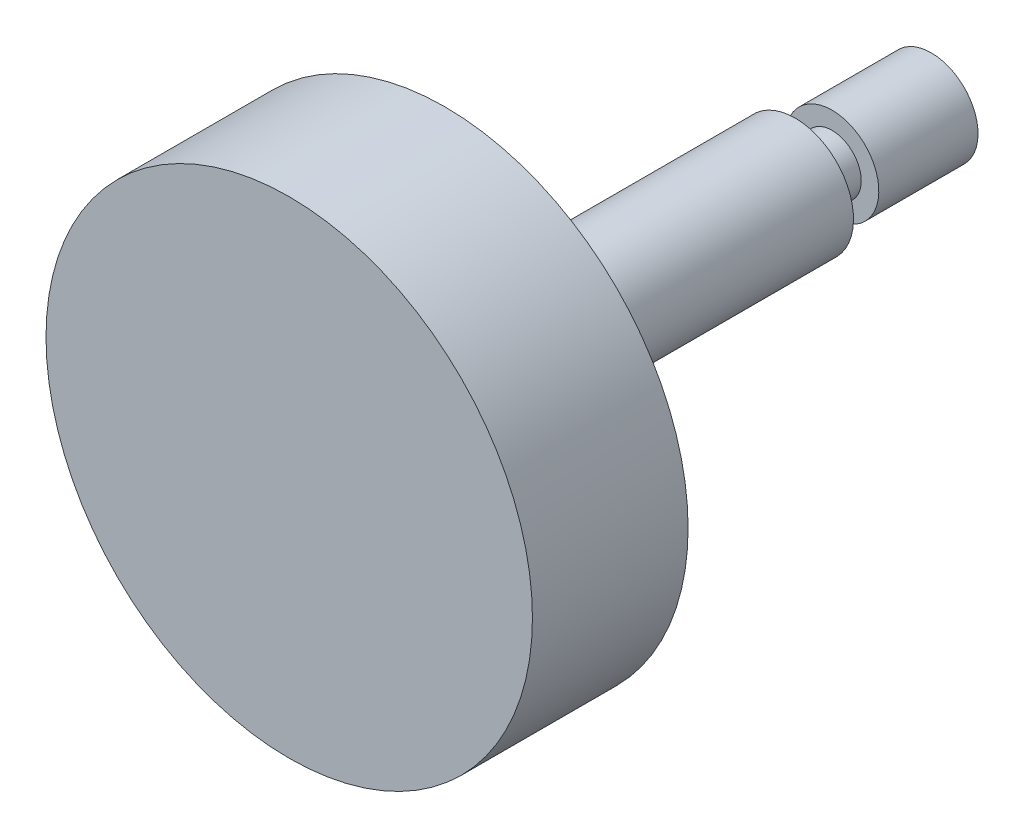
ISO-10303-21;
HEADER;
FILE_DESCRIPTION(('STEP AP214'),'2;1');
FILE_NAME('part.step','',(''),(''),'','','');
FILE_SCHEMA(('AUTOMOTIVE_DESIGN { 1 0 10303 214 1 1 1 1 }'));
ENDSEC;
DATA;
#1=APPLICATION_CONTEXT('core data for automotive mechanical design processes');
#2=APPLICATION_PROTOCOL_DEFINITION('international standard','automotive_design',2000,#1);
#3=PRODUCT_CONTEXT('',#1,'mechanical');
#4=PRODUCT('Part','Part','',(#3));
#5=PRODUCT_RELATED_PRODUCT_CATEGORY('part','',(#4));
#6=PRODUCT_DEFINITION_FORMATION('','',#4);
#7=PRODUCT_DEFINITION_CONTEXT('part definition',#1,'design');
#8=PRODUCT_DEFINITION('design','',#6,#7);
#9=PRODUCT_DEFINITION_SHAPE('','',#8);
#10=(LENGTH_UNIT() NAMED_UNIT(*) SI_UNIT(.MILLI.,.METRE.));
#11=(NAMED_UNIT(*) PLANE_ANGLE_UNIT() SI_UNIT($,.RADIAN.));
#12=(NAMED_UNIT(*) SI_UNIT($,.STERADIAN.) SOLID_ANGLE_UNIT());
#13=UNCERTAINTY_MEASURE_WITH_UNIT(LENGTH_MEASURE(1.E-05),#10,'distance_accuracy_value','');
#14=(GEOMETRIC_REPRESENTATION_CONTEXT(3) GLOBAL_UNCERTAINTY_ASSIGNED_CONTEXT((#13)) GLOBAL_UNIT_ASSIGNED_CONTEXT((#10,
#11,#12)) REPRESENTATION_CONTEXT('',''));
#15=CARTESIAN_POINT('',(0.,0.,0.));
#16=DIRECTION('',(0.,0.,1.));
#17=DIRECTION('',(1.,0.,0.));
#18=AXIS2_PLACEMENT_3D('',#15,#16,#17);
#19=CARTESIAN_POINT('',(0.,-3.,7.));
#20=DIRECTION('',(0.,0.,-1.));
#21=DIRECTION('',(0.,-1.,0.));
#22=AXIS2_PLACEMENT_3D('',#19,#20,#21);
#23=PLANE('',#22);
#24=CARTESIAN_POINT('',(0.,0.,7.));
#25=DIRECTION('',(0.,0.,1.));
#26=DIRECTION('',(0.,1.,0.));
#27=AXIS2_PLACEMENT_3D('',#24,#25,#26);
#28=CIRCLE('',#27,1.5);
#29=CARTESIAN_POINT('',(0.,1.5,7.));
#30=VERTEX_POINT('',#29);
#31=EDGE_CURVE('E40',#30,#30,#28,.T.);
#32=ORIENTED_EDGE('',*,*,#31,.T.);
#33=EDGE_LOOP('',(#32));
#34=FACE_BOUND('',#33,.T.);
#35=CARTESIAN_POINT('',(0.,0.,7.));
#36=DIRECTION('',(0.,0.,1.));
#37=DIRECTION('',(0.,1.,0.));
#38=AXIS2_PLACEMENT_3D('',#35,#36,#37);
#39=CIRCLE('',#38,3.);
#40=CARTESIAN_POINT('',(0.,3.,7.));
#41=VERTEX_POINT('',#40);
#42=EDGE_CURVE('E8',#41,#41,#39,.T.);
#43=ORIENTED_EDGE('',*,*,#42,.F.);
#44=EDGE_LOOP('',(#43));
#45=FACE_BOUND('',#44,.T.);
#46=ADVANCED_FACE('F12',(#34,#45),#23,.T.);
#47=CARTESIAN_POINT('',(0.,0.,33.));
#48=DIRECTION('',(0.,0.,1.));
#49=DIRECTION('',(0.,1.,0.));
#50=AXIS2_PLACEMENT_3D('',#47,#48,#49);
#51=CYLINDRICAL_SURFACE('',#50,3.);
#52=CARTESIAN_POINT('',(0.,0.,25.));
#53=DIRECTION('',(0.,0.,1.));
#54=DIRECTION('',(0.,1.,0.));
#55=AXIS2_PLACEMENT_3D('',#52,#53,#54);
#56=CIRCLE('',#55,3.);
#57=CARTESIAN_POINT('',(0.,3.,25.));
#58=VERTEX_POINT('',#57);
#59=EDGE_CURVE('E18',#58,#58,#56,.T.);
#60=ORIENTED_EDGE('',*,*,#59,.F.);
#61=EDGE_LOOP('',(#60));
#62=FACE_BOUND('',#61,.T.);
#63=ORIENTED_EDGE('',*,*,#42,.T.);
#64=EDGE_LOOP('',(#63));
#65=FACE_BOUND('',#64,.T.);
#66=ADVANCED_FACE('F59',(#62,#65),#51,.T.);
#67=CARTESIAN_POINT('',(0.,-12.5,25.));
#68=DIRECTION('',(0.,0.,-1.));
#69=DIRECTION('',(0.,-1.,0.));
#70=AXIS2_PLACEMENT_3D('',#67,#68,#69);
#71=PLANE('',#70);
#72=ORIENTED_EDGE('',*,*,#59,.T.);
#73=EDGE_LOOP('',(#72));
#74=FACE_BOUND('',#73,.T.);
#75=CARTESIAN_POINT('',(0.,0.,25.));
#76=DIRECTION('',(0.,0.,1.));
#77=DIRECTION('',(0.,1.,0.));
#78=AXIS2_PLACEMENT_3D('',#75,#76,#77);
#79=CIRCLE('',#78,12.5);
#80=CARTESIAN_POINT('',(0.,12.5,25.));
#81=VERTEX_POINT('',#80);
#82=EDGE_CURVE('E22',#81,#81,#79,.T.);
#83=ORIENTED_EDGE('',*,*,#82,.F.);
#84=EDGE_LOOP('',(#83));
#85=FACE_BOUND('',#84,.T.);
#86=ADVANCED_FACE('F63',(#74,#85),#71,.T.);
#87=CARTESIAN_POINT('',(0.,0.,33.));
#88=DIRECTION('',(0.,0.,1.));
#89=DIRECTION('',(0.,1.,0.));
#90=AXIS2_PLACEMENT_3D('',#87,#88,#89);
#91=CYLINDRICAL_SURFACE('',#90,12.5);
#92=CARTESIAN_POINT('',(0.,0.,33.));
#93=DIRECTION('',(0.,0.,1.));
#94=DIRECTION('',(0.,1.,0.));
#95=AXIS2_PLACEMENT_3D('',#92,#93,#94);
#96=CIRCLE('',#95,12.5);
#97=CARTESIAN_POINT('',(0.,12.5,33.));
#98=VERTEX_POINT('',#97);
#99=EDGE_CURVE('E26',#98,#98,#96,.T.);
#100=ORIENTED_EDGE('',*,*,#99,.F.);
#101=EDGE_LOOP('',(#100));
#102=FACE_BOUND('',#101,.T.);
#103=ORIENTED_EDGE('',*,*,#82,.T.);
#104=EDGE_LOOP('',(#103));
#105=FACE_BOUND('',#104,.T.);
#106=ADVANCED_FACE('F68',(#102,#105),#91,.T.);
#107=CARTESIAN_POINT('',(0.,-12.5,33.));
#108=DIRECTION('',(0.,0.,-1.));
#109=DIRECTION('',(0.,-1.,0.));
#110=AXIS2_PLACEMENT_3D('',#107,#108,#109);
#111=PLANE('',#110);
#112=ORIENTED_EDGE('',*,*,#99,.T.);
#113=EDGE_LOOP('',(#112));
#114=FACE_BOUND('',#113,.T.);
#115=ADVANCED_FACE('F73',(#114),#111,.F.);
#116=CARTESIAN_POINT('',(0.,-2.4,0.));
#117=DIRECTION('',(0.,0.,-1.));
#118=DIRECTION('',(0.,-1.,0.));
#119=AXIS2_PLACEMENT_3D('',#116,#117,#118);
#120=PLANE('',#119);
#121=CARTESIAN_POINT('',(0.,0.,0.));
#122=DIRECTION('',(0.,0.,1.));
#123=DIRECTION('',(0.,1.,0.));
#124=AXIS2_PLACEMENT_3D('',#121,#122,#123);
#125=CIRCLE('',#124,2.4);
#126=CARTESIAN_POINT('',(0.,2.4,0.));
#127=VERTEX_POINT('',#126);
#128=EDGE_CURVE('E31',#127,#127,#125,.T.);
#129=ORIENTED_EDGE('',*,*,#128,.F.);
#130=EDGE_LOOP('',(#129));
#131=FACE_BOUND('',#130,.T.);
#132=ADVANCED_FACE('F77',(#131),#120,.T.);
#133=CARTESIAN_POINT('',(0.,0.,33.));
#134=DIRECTION('',(0.,0.,1.));
#135=DIRECTION('',(0.,1.,0.));
#136=AXIS2_PLACEMENT_3D('',#133,#134,#135);
#137=CYLINDRICAL_SURFACE('',#136,2.4);
#138=ORIENTED_EDGE('',*,*,#128,.T.);
#139=EDGE_LOOP('',(#138));
#140=FACE_BOUND('',#139,.T.);
#141=CARTESIAN_POINT('',(0.,0.,5.1));
#142=DIRECTION('',(0.,0.,1.));
#143=DIRECTION('',(0.,1.,0.));
#144=AXIS2_PLACEMENT_3D('',#141,#142,#143);
#145=CIRCLE('',#144,2.4);
#146=CARTESIAN_POINT('',(0.,2.4,5.1));
#147=VERTEX_POINT('',#146);
#148=EDGE_CURVE('E34',#147,#147,#145,.T.);
#149=ORIENTED_EDGE('',*,*,#148,.F.);
#150=EDGE_LOOP('',(#149));
#151=FACE_BOUND('',#150,.T.);
#152=ADVANCED_FACE('F55',(#140,#151),#137,.T.);
#153=CARTESIAN_POINT('',(0.,-1.5,5.1));
#154=DIRECTION('',(0.,0.,1.));
#155=DIRECTION('',(0.,1.,0.));
#156=AXIS2_PLACEMENT_3D('',#153,#154,#155);
#157=PLANE('',#156);
#158=ORIENTED_EDGE('',*,*,#148,.T.);
#159=EDGE_LOOP('',(#158));
#160=FACE_BOUND('',#159,.T.);
#161=CARTESIAN_POINT('',(0.,0.,5.1));
#162=DIRECTION('',(0.,0.,1.));
#163=DIRECTION('',(0.,1.,0.));
#164=AXIS2_PLACEMENT_3D('',#161,#162,#163);
#165=CIRCLE('',#164,1.5);
#166=CARTESIAN_POINT('',(0.,1.5,5.1));
#167=VERTEX_POINT('',#166);
#168=EDGE_CURVE('E37',#167,#167,#165,.T.);
#169=ORIENTED_EDGE('',*,*,#168,.F.);
#170=EDGE_LOOP('',(#169));
#171=FACE_BOUND('',#170,.T.);
#172=ADVANCED_FACE('F48',(#160,#171),#157,.T.);
#173=CARTESIAN_POINT('',(0.,0.,33.));
#174=DIRECTION('',(0.,0.,1.));
#175=DIRECTION('',(0.,1.,0.));
#176=AXIS2_PLACEMENT_3D('',#173,#174,#175);
#177=CYLINDRICAL_SURFACE('',#176,1.5);
#178=ORIENTED_EDGE('',*,*,#168,.T.);
#179=EDGE_LOOP('',(#178));
#180=FACE_BOUND('',#179,.T.);
#181=ORIENTED_EDGE('',*,*,#31,.F.);
#182=EDGE_LOOP('',(#181));
#183=FACE_BOUND('',#182,.T.);
#184=ADVANCED_FACE('F46',(#180,#183),#177,.T.);
#185=CLOSED_SHELL('',(#46,#66,#86,#106,#115,#132,#152,#172,#184));
#186=MANIFOLD_SOLID_BREP('B1',#185);
#187=ADVANCED_BREP_SHAPE_REPRESENTATION('',(#18,#186),#14);
#188=SHAPE_DEFINITION_REPRESENTATION(#9,#187);
ENDSEC;
END-ISO-10303-21;
